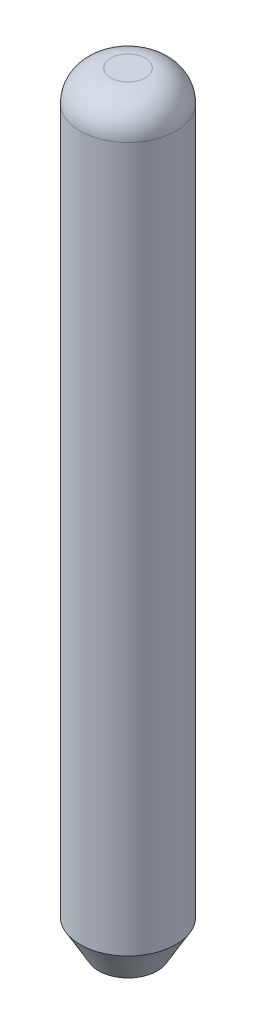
from build123d import *


with BuildPart() as part:
    # Sketch1 → Base-Revolve (revolve)
    with BuildSketch(Plane.XY, mode=Mode.PRIVATE) as base_revolve_sk:
        with BuildLine():
            Line((0, 0), (0, 6.35))
            Line((0, 6.35), (0.14224, 6.35))
            ThreePointArc((0.14224, 6.35), (0.321845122, 6.275605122), (0.39624, 6.096))
            Line((0.39624, 6.096), (0.39624, 0.265516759))
            Line((0.39624, 0.265516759), (0.242943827, 0))
            Line((0.242943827, 0), (0, 0))
        make_face()
    revolve(base_revolve_sk.sketch.rotate(Axis((0, 0, 0), (0, 1, 0)), 90), axis=Axis((0, 0, 0), (0, 1, 0)))


solid = part.part
